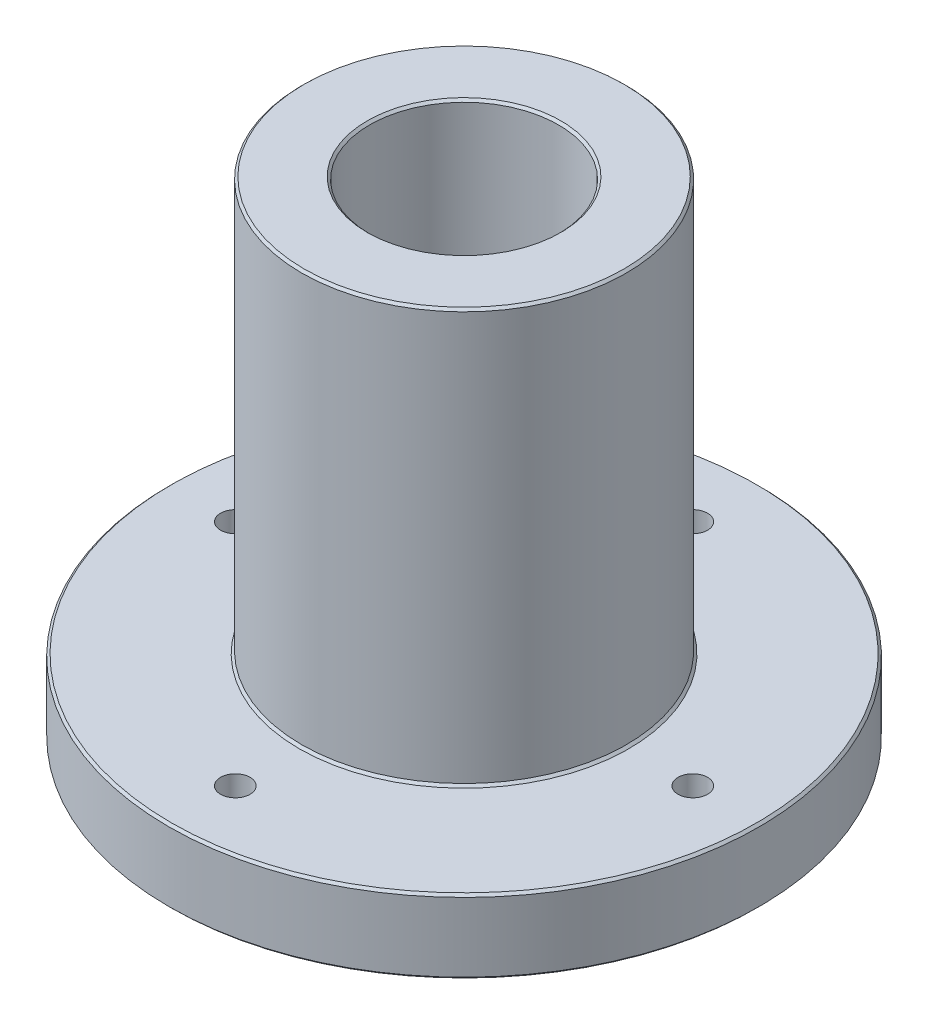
ISO-10303-21;
HEADER;
FILE_DESCRIPTION(('STEP AP214'),'2;1');
FILE_NAME('part.step','',(''),(''),'','','');
FILE_SCHEMA(('AUTOMOTIVE_DESIGN { 1 0 10303 214 1 1 1 1 }'));
ENDSEC;
DATA;
#1=APPLICATION_CONTEXT('core data for automotive mechanical design processes');
#2=APPLICATION_PROTOCOL_DEFINITION('international standard','automotive_design',2000,#1);
#3=PRODUCT_CONTEXT('',#1,'mechanical');
#4=PRODUCT('Part','Part','',(#3));
#5=PRODUCT_RELATED_PRODUCT_CATEGORY('part','',(#4));
#6=PRODUCT_DEFINITION_FORMATION('','',#4);
#7=PRODUCT_DEFINITION_CONTEXT('part definition',#1,'design');
#8=PRODUCT_DEFINITION('design','',#6,#7);
#9=PRODUCT_DEFINITION_SHAPE('','',#8);
#10=(LENGTH_UNIT() NAMED_UNIT(*) SI_UNIT(.MILLI.,.METRE.));
#11=(NAMED_UNIT(*) PLANE_ANGLE_UNIT() SI_UNIT($,.RADIAN.));
#12=(NAMED_UNIT(*) SI_UNIT($,.STERADIAN.) SOLID_ANGLE_UNIT());
#13=UNCERTAINTY_MEASURE_WITH_UNIT(LENGTH_MEASURE(1.E-05),#10,'distance_accuracy_value','');
#14=(GEOMETRIC_REPRESENTATION_CONTEXT(3) GLOBAL_UNCERTAINTY_ASSIGNED_CONTEXT((#13)) GLOBAL_UNIT_ASSIGNED_CONTEXT((#10,
#11,#12)) REPRESENTATION_CONTEXT('',''));
#15=CARTESIAN_POINT('',(0.,0.,0.));
#16=DIRECTION('',(0.,0.,1.));
#17=DIRECTION('',(1.,0.,0.));
#18=AXIS2_PLACEMENT_3D('',#15,#16,#17);
#19=CARTESIAN_POINT('',(0.,7.9375,0.));
#20=DIRECTION('',(0.,1.,0.));
#21=DIRECTION('',(0.,0.,1.));
#22=AXIS2_PLACEMENT_3D('',#19,#20,#21);
#23=PLANE('',#22);
#24=CARTESIAN_POINT('',(0.,7.9375,0.));
#25=DIRECTION('',(0.,1.,0.));
#26=DIRECTION('',(0.,0.,1.));
#27=AXIS2_PLACEMENT_3D('',#24,#25,#26);
#28=CIRCLE('',#27,17.7165);
#29=CARTESIAN_POINT('',(0.,7.9375,17.7165));
#30=VERTEX_POINT('',#29);
#31=EDGE_CURVE('E57',#30,#30,#28,.F.);
#32=ORIENTED_EDGE('',*,*,#31,.T.);
#33=EDGE_LOOP('',(#32));
#34=FACE_BOUND('',#33,.T.);
#35=CARTESIAN_POINT('',(0.,7.9375,0.));
#36=DIRECTION('',(0.,1.,0.));
#37=DIRECTION('',(0.,0.,1.));
#38=AXIS2_PLACEMENT_3D('',#35,#36,#37);
#39=CIRCLE('',#38,31.496);
#40=CARTESIAN_POINT('',(0.,7.9375,31.496));
#41=VERTEX_POINT('',#40);
#42=EDGE_CURVE('E60',#41,#41,#39,.T.);
#43=ORIENTED_EDGE('',*,*,#42,.T.);
#44=EDGE_LOOP('',(#43));
#45=FACE_BOUND('',#44,.T.);
#46=CARTESIAN_POINT('',(-24.60625,7.9375,0.));
#47=DIRECTION('',(0.,1.,0.));
#48=DIRECTION('',(0.,0.,1.));
#49=AXIS2_PLACEMENT_3D('',#46,#47,#48);
#50=CIRCLE('',#49,1.5875);
#51=CARTESIAN_POINT('',(-24.60625,7.9375,1.5875));
#52=VERTEX_POINT('',#51);
#53=EDGE_CURVE('E91',#52,#52,#50,.T.);
#54=ORIENTED_EDGE('',*,*,#53,.F.);
#55=EDGE_LOOP('',(#54));
#56=FACE_BOUND('',#55,.T.);
#57=CARTESIAN_POINT('',(0.,7.9375,-24.60625));
#58=DIRECTION('',(0.,1.,0.));
#59=DIRECTION('',(0.,0.,1.));
#60=AXIS2_PLACEMENT_3D('',#57,#58,#59);
#61=CIRCLE('',#60,1.5875);
#62=CARTESIAN_POINT('',(0.,7.9375,-23.01875));
#63=VERTEX_POINT('',#62);
#64=EDGE_CURVE('E85',#63,#63,#61,.T.);
#65=ORIENTED_EDGE('',*,*,#64,.F.);
#66=EDGE_LOOP('',(#65));
#67=FACE_BOUND('',#66,.T.);
#68=CARTESIAN_POINT('',(24.60625,7.9375,0.));
#69=DIRECTION('',(0.,1.,0.));
#70=DIRECTION('',(0.,0.,1.));
#71=AXIS2_PLACEMENT_3D('',#68,#69,#70);
#72=CIRCLE('',#71,1.5875);
#73=CARTESIAN_POINT('',(24.60625,7.9375,1.5875));
#74=VERTEX_POINT('',#73);
#75=EDGE_CURVE('E79',#74,#74,#72,.T.);
#76=ORIENTED_EDGE('',*,*,#75,.F.);
#77=EDGE_LOOP('',(#76));
#78=FACE_BOUND('',#77,.T.);
#79=CARTESIAN_POINT('',(0.,7.9375,24.60625));
#80=DIRECTION('',(0.,1.,0.));
#81=DIRECTION('',(0.,0.,1.));
#82=AXIS2_PLACEMENT_3D('',#79,#80,#81);
#83=CIRCLE('',#82,1.5875);
#84=CARTESIAN_POINT('',(0.,7.9375,26.19375));
#85=VERTEX_POINT('',#84);
#86=EDGE_CURVE('E73',#85,#85,#83,.T.);
#87=ORIENTED_EDGE('',*,*,#86,.F.);
#88=EDGE_LOOP('',(#87));
#89=FACE_BOUND('',#88,.T.);
#90=ADVANCED_FACE('F31',(#34,#45,#56,#67,#78,#89),#23,.T.);
#91=CARTESIAN_POINT('',(0.,0.,0.));
#92=DIRECTION('',(0.,1.,0.));
#93=DIRECTION('',(0.,0.,1.));
#94=AXIS2_PLACEMENT_3D('',#91,#92,#93);
#95=PLANE('',#94);
#96=CARTESIAN_POINT('',(0.,0.,0.));
#97=DIRECTION('',(0.,1.,0.));
#98=DIRECTION('',(0.,0.,1.));
#99=AXIS2_PLACEMENT_3D('',#96,#97,#98);
#100=CIRCLE('',#99,31.496);
#101=CARTESIAN_POINT('',(0.,0.,31.496));
#102=VERTEX_POINT('',#101);
#103=EDGE_CURVE('E10',#102,#102,#100,.F.);
#104=ORIENTED_EDGE('',*,*,#103,.T.);
#105=EDGE_LOOP('',(#104));
#106=FACE_BOUND('',#105,.T.);
#107=CARTESIAN_POINT('',(-24.60625,0.,0.));
#108=DIRECTION('',(0.,1.,0.));
#109=DIRECTION('',(0.,0.,1.));
#110=AXIS2_PLACEMENT_3D('',#107,#108,#109);
#111=CIRCLE('',#110,1.5875);
#112=CARTESIAN_POINT('',(-24.60625,0.,1.5875));
#113=VERTEX_POINT('',#112);
#114=EDGE_CURVE('E72',#113,#113,#111,.T.);
#115=ORIENTED_EDGE('',*,*,#114,.T.);
#116=EDGE_LOOP('',(#115));
#117=FACE_BOUND('',#116,.T.);
#118=CARTESIAN_POINT('',(0.,0.,-24.60625));
#119=DIRECTION('',(0.,1.,0.));
#120=DIRECTION('',(0.,0.,1.));
#121=AXIS2_PLACEMENT_3D('',#118,#119,#120);
#122=CIRCLE('',#121,1.5875);
#123=CARTESIAN_POINT('',(0.,0.,-23.01875));
#124=VERTEX_POINT('',#123);
#125=EDGE_CURVE('E88',#124,#124,#122,.T.);
#126=ORIENTED_EDGE('',*,*,#125,.T.);
#127=EDGE_LOOP('',(#126));
#128=FACE_BOUND('',#127,.T.);
#129=CARTESIAN_POINT('',(24.60625,0.,0.));
#130=DIRECTION('',(0.,1.,0.));
#131=DIRECTION('',(0.,0.,1.));
#132=AXIS2_PLACEMENT_3D('',#129,#130,#131);
#133=CIRCLE('',#132,1.5875);
#134=CARTESIAN_POINT('',(24.60625,0.,1.5875));
#135=VERTEX_POINT('',#134);
#136=EDGE_CURVE('E82',#135,#135,#133,.T.);
#137=ORIENTED_EDGE('',*,*,#136,.T.);
#138=EDGE_LOOP('',(#137));
#139=FACE_BOUND('',#138,.T.);
#140=CARTESIAN_POINT('',(0.,0.,24.60625));
#141=DIRECTION('',(0.,1.,0.));
#142=DIRECTION('',(0.,0.,1.));
#143=AXIS2_PLACEMENT_3D('',#140,#141,#142);
#144=CIRCLE('',#143,1.5875);
#145=CARTESIAN_POINT('',(0.,0.,26.19375));
#146=VERTEX_POINT('',#145);
#147=EDGE_CURVE('E76',#146,#146,#144,.T.);
#148=ORIENTED_EDGE('',*,*,#147,.T.);
#149=EDGE_LOOP('',(#148));
#150=FACE_BOUND('',#149,.T.);
#151=CARTESIAN_POINT('',(0.,0.,0.));
#152=DIRECTION('',(0.,1.,0.));
#153=DIRECTION('',(0.,0.,1.));
#154=AXIS2_PLACEMENT_3D('',#151,#152,#153);
#155=CIRCLE('',#154,10.16);
#156=CARTESIAN_POINT('',(0.,0.,10.16));
#157=VERTEX_POINT('',#156);
#158=EDGE_CURVE('E69',#157,#157,#155,.T.);
#159=ORIENTED_EDGE('',*,*,#158,.T.);
#160=EDGE_LOOP('',(#159));
#161=FACE_BOUND('',#160,.T.);
#162=ADVANCED_FACE('F97',(#106,#117,#128,#139,#150,#161),#95,.F.);
#163=CARTESIAN_POINT('',(0.,7.9375,0.));
#164=DIRECTION('',(0.,-1.,0.));
#165=DIRECTION('',(0.,0.,-1.));
#166=AXIS2_PLACEMENT_3D('',#163,#164,#165);
#167=CYLINDRICAL_SURFACE('',#166,31.75);
#168=CARTESIAN_POINT('',(0.,0.254000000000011,0.));
#169=DIRECTION('',(0.,1.,0.));
#170=DIRECTION('',(0.,0.,1.));
#171=AXIS2_PLACEMENT_3D('',#168,#169,#170);
#172=CIRCLE('',#171,31.75);
#173=CARTESIAN_POINT('',(0.,0.254000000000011,31.75));
#174=VERTEX_POINT('',#173);
#175=EDGE_CURVE('E38',#174,#174,#172,.T.);
#176=ORIENTED_EDGE('',*,*,#175,.T.);
#177=EDGE_LOOP('',(#176));
#178=FACE_BOUND('',#177,.T.);
#179=CARTESIAN_POINT('',(0.,7.68350000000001,0.));
#180=DIRECTION('',(0.,1.,0.));
#181=DIRECTION('',(0.,0.,1.));
#182=AXIS2_PLACEMENT_3D('',#179,#180,#181);
#183=CIRCLE('',#182,31.75);
#184=CARTESIAN_POINT('',(0.,7.68350000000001,31.75));
#185=VERTEX_POINT('',#184);
#186=EDGE_CURVE('E42',#185,#185,#183,.F.);
#187=ORIENTED_EDGE('',*,*,#186,.T.);
#188=EDGE_LOOP('',(#187));
#189=FACE_BOUND('',#188,.T.);
#190=ADVANCED_FACE('F141',(#178,#189),#167,.T.);
#191=CARTESIAN_POINT('',(0.,7.9375,0.));
#192=DIRECTION('',(0.,-1.,0.));
#193=DIRECTION('',(0.,0.,-1.));
#194=AXIS2_PLACEMENT_3D('',#191,#192,#193);
#195=CYLINDRICAL_SURFACE('',#194,10.16);
#196=CARTESIAN_POINT('',(0.,52.1335,0.));
#197=DIRECTION('',(0.,1.,0.));
#198=DIRECTION('',(0.,0.,1.));
#199=AXIS2_PLACEMENT_3D('',#196,#197,#198);
#200=CIRCLE('',#199,10.16);
#201=CARTESIAN_POINT('',(0.,52.1335,10.16));
#202=VERTEX_POINT('',#201);
#203=EDGE_CURVE('E54',#202,#202,#200,.T.);
#204=ORIENTED_EDGE('',*,*,#203,.T.);
#205=EDGE_LOOP('',(#204));
#206=FACE_BOUND('',#205,.T.);
#207=ORIENTED_EDGE('',*,*,#158,.F.);
#208=EDGE_LOOP('',(#207));
#209=FACE_BOUND('',#208,.T.);
#210=ADVANCED_FACE('F137',(#206,#209),#195,.F.);
#211=CARTESIAN_POINT('',(0.,52.3875,0.));
#212=DIRECTION('',(0.,1.,0.));
#213=DIRECTION('',(0.,0.,1.));
#214=AXIS2_PLACEMENT_3D('',#211,#212,#213);
#215=PLANE('',#214);
#216=CARTESIAN_POINT('',(0.,52.3875,0.));
#217=DIRECTION('',(0.,1.,0.));
#218=DIRECTION('',(0.,0.,1.));
#219=AXIS2_PLACEMENT_3D('',#216,#217,#218);
#220=CIRCLE('',#219,10.414);
#221=CARTESIAN_POINT('',(0.,52.3875,10.414));
#222=VERTEX_POINT('',#221);
#223=EDGE_CURVE('E46',#222,#222,#220,.F.);
#224=ORIENTED_EDGE('',*,*,#223,.T.);
#225=EDGE_LOOP('',(#224));
#226=FACE_BOUND('',#225,.T.);
#227=CARTESIAN_POINT('',(0.,52.3875,0.));
#228=DIRECTION('',(0.,1.,0.));
#229=DIRECTION('',(0.,0.,1.));
#230=AXIS2_PLACEMENT_3D('',#227,#228,#229);
#231=CIRCLE('',#230,17.2085);
#232=CARTESIAN_POINT('',(0.,52.3875,17.2085));
#233=VERTEX_POINT('',#232);
#234=EDGE_CURVE('E51',#233,#233,#231,.T.);
#235=ORIENTED_EDGE('',*,*,#234,.T.);
#236=EDGE_LOOP('',(#235));
#237=FACE_BOUND('',#236,.T.);
#238=ADVANCED_FACE('F130',(#226,#237),#215,.T.);
#239=CARTESIAN_POINT('',(0.,52.3875,0.));
#240=DIRECTION('',(0.,-1.,0.));
#241=DIRECTION('',(0.,0.,-1.));
#242=AXIS2_PLACEMENT_3D('',#239,#240,#241);
#243=CYLINDRICAL_SURFACE('',#242,17.4625);
#244=CARTESIAN_POINT('',(0.,8.19150000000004,0.));
#245=DIRECTION('',(0.,1.,0.));
#246=DIRECTION('',(0.,0.,1.));
#247=AXIS2_PLACEMENT_3D('',#244,#245,#246);
#248=CIRCLE('',#247,17.4625);
#249=CARTESIAN_POINT('',(0.,8.19150000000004,17.4625));
#250=VERTEX_POINT('',#249);
#251=EDGE_CURVE('E63',#250,#250,#248,.T.);
#252=ORIENTED_EDGE('',*,*,#251,.T.);
#253=EDGE_LOOP('',(#252));
#254=FACE_BOUND('',#253,.T.);
#255=CARTESIAN_POINT('',(0.,52.1335,0.));
#256=DIRECTION('',(0.,1.,0.));
#257=DIRECTION('',(0.,0.,1.));
#258=AXIS2_PLACEMENT_3D('',#255,#256,#257);
#259=CIRCLE('',#258,17.4625);
#260=CARTESIAN_POINT('',(0.,52.1335,17.4625));
#261=VERTEX_POINT('',#260);
#262=EDGE_CURVE('E66',#261,#261,#259,.F.);
#263=ORIENTED_EDGE('',*,*,#262,.T.);
#264=EDGE_LOOP('',(#263));
#265=FACE_BOUND('',#264,.T.);
#266=ADVANCED_FACE('F121',(#254,#265),#243,.T.);
#267=CARTESIAN_POINT('',(0.,0.,24.60625));
#268=DIRECTION('',(0.,1.,0.));
#269=DIRECTION('',(0.,0.,1.));
#270=AXIS2_PLACEMENT_3D('',#267,#268,#269);
#271=CYLINDRICAL_SURFACE('',#270,1.5875);
#272=ORIENTED_EDGE('',*,*,#147,.F.);
#273=EDGE_LOOP('',(#272));
#274=FACE_BOUND('',#273,.T.);
#275=ORIENTED_EDGE('',*,*,#86,.T.);
#276=EDGE_LOOP('',(#275));
#277=FACE_BOUND('',#276,.T.);
#278=ADVANCED_FACE('F118',(#274,#277),#271,.F.);
#279=CARTESIAN_POINT('',(24.60625,0.,0.));
#280=DIRECTION('',(0.,1.,0.));
#281=DIRECTION('',(0.,0.,1.));
#282=AXIS2_PLACEMENT_3D('',#279,#280,#281);
#283=CYLINDRICAL_SURFACE('',#282,1.5875);
#284=ORIENTED_EDGE('',*,*,#136,.F.);
#285=EDGE_LOOP('',(#284));
#286=FACE_BOUND('',#285,.T.);
#287=ORIENTED_EDGE('',*,*,#75,.T.);
#288=EDGE_LOOP('',(#287));
#289=FACE_BOUND('',#288,.T.);
#290=ADVANCED_FACE('F120',(#286,#289),#283,.F.);
#291=CARTESIAN_POINT('',(0.,0.,-24.60625));
#292=DIRECTION('',(0.,1.,0.));
#293=DIRECTION('',(0.,0.,1.));
#294=AXIS2_PLACEMENT_3D('',#291,#292,#293);
#295=CYLINDRICAL_SURFACE('',#294,1.5875);
#296=ORIENTED_EDGE('',*,*,#125,.F.);
#297=EDGE_LOOP('',(#296));
#298=FACE_BOUND('',#297,.T.);
#299=ORIENTED_EDGE('',*,*,#64,.T.);
#300=EDGE_LOOP('',(#299));
#301=FACE_BOUND('',#300,.T.);
#302=ADVANCED_FACE('F104',(#298,#301),#295,.F.);
#303=CARTESIAN_POINT('',(-24.60625,0.,0.));
#304=DIRECTION('',(0.,1.,0.));
#305=DIRECTION('',(0.,0.,1.));
#306=AXIS2_PLACEMENT_3D('',#303,#304,#305);
#307=CYLINDRICAL_SURFACE('',#306,1.5875);
#308=ORIENTED_EDGE('',*,*,#114,.F.);
#309=EDGE_LOOP('',(#308));
#310=FACE_BOUND('',#309,.T.);
#311=ORIENTED_EDGE('',*,*,#53,.T.);
#312=EDGE_LOOP('',(#311));
#313=FACE_BOUND('',#312,.T.);
#314=ADVANCED_FACE('F100',(#310,#313),#307,.F.);
#315=CARTESIAN_POINT('',(0.,8.19150000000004,0.));
#316=DIRECTION('',(0.,-1.,0.));
#317=DIRECTION('',(0.,0.,-1.));
#318=AXIS2_PLACEMENT_3D('',#315,#316,#317);
#319=CONICAL_SURFACE('',#318,17.4625,0.785398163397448);
#320=ORIENTED_EDGE('',*,*,#31,.F.);
#321=EDGE_LOOP('',(#320));
#322=FACE_BOUND('',#321,.T.);
#323=ORIENTED_EDGE('',*,*,#251,.F.);
#324=EDGE_LOOP('',(#323));
#325=FACE_BOUND('',#324,.T.);
#326=ADVANCED_FACE('F103',(#322,#325),#319,.T.);
#327=CARTESIAN_POINT('',(0.,52.1335,0.));
#328=DIRECTION('',(0.,1.,0.));
#329=DIRECTION('',(0.,0.,1.));
#330=AXIS2_PLACEMENT_3D('',#327,#328,#329);
#331=CONICAL_SURFACE('',#330,10.16,0.785398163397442);
#332=ORIENTED_EDGE('',*,*,#223,.F.);
#333=EDGE_LOOP('',(#332));
#334=FACE_BOUND('',#333,.T.);
#335=ORIENTED_EDGE('',*,*,#203,.F.);
#336=EDGE_LOOP('',(#335));
#337=FACE_BOUND('',#336,.T.);
#338=ADVANCED_FACE('F150',(#334,#337),#331,.F.);
#339=CARTESIAN_POINT('',(0.,52.3875,0.));
#340=DIRECTION('',(0.,-1.,0.));
#341=DIRECTION('',(0.,0.,-1.));
#342=AXIS2_PLACEMENT_3D('',#339,#340,#341);
#343=CONICAL_SURFACE('',#342,17.2085,0.785398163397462);
#344=ORIENTED_EDGE('',*,*,#262,.F.);
#345=EDGE_LOOP('',(#344));
#346=FACE_BOUND('',#345,.T.);
#347=ORIENTED_EDGE('',*,*,#234,.F.);
#348=EDGE_LOOP('',(#347));
#349=FACE_BOUND('',#348,.T.);
#350=ADVANCED_FACE('F154',(#346,#349),#343,.T.);
#351=CARTESIAN_POINT('',(0.,0.254000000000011,0.));
#352=DIRECTION('',(0.,1.,0.));
#353=DIRECTION('',(0.,0.,1.));
#354=AXIS2_PLACEMENT_3D('',#351,#352,#353);
#355=CONICAL_SURFACE('',#354,31.75,0.785398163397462);
#356=ORIENTED_EDGE('',*,*,#103,.F.);
#357=EDGE_LOOP('',(#356));
#358=FACE_BOUND('',#357,.T.);
#359=ORIENTED_EDGE('',*,*,#175,.F.);
#360=EDGE_LOOP('',(#359));
#361=FACE_BOUND('',#360,.T.);
#362=ADVANCED_FACE('F157',(#358,#361),#355,.T.);
#363=CARTESIAN_POINT('',(0.,7.9375,0.));
#364=DIRECTION('',(0.,-1.,0.));
#365=DIRECTION('',(0.,0.,-1.));
#366=AXIS2_PLACEMENT_3D('',#363,#364,#365);
#367=CONICAL_SURFACE('',#366,31.496,0.785398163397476);
#368=ORIENTED_EDGE('',*,*,#186,.F.);
#369=EDGE_LOOP('',(#368));
#370=FACE_BOUND('',#369,.T.);
#371=ORIENTED_EDGE('',*,*,#42,.F.);
#372=EDGE_LOOP('',(#371));
#373=FACE_BOUND('',#372,.T.);
#374=ADVANCED_FACE('F33',(#370,#373),#367,.T.);
#375=CLOSED_SHELL('',(#90,#162,#190,#210,#238,#266,#278,#290,#302,#314,#326,#338,#350,#362,#374));
#376=MANIFOLD_SOLID_BREP('B2',#375);
#377=ADVANCED_BREP_SHAPE_REPRESENTATION('',(#18,#376),#14);
#378=SHAPE_DEFINITION_REPRESENTATION(#9,#377);
ENDSEC;
END-ISO-10303-21;
